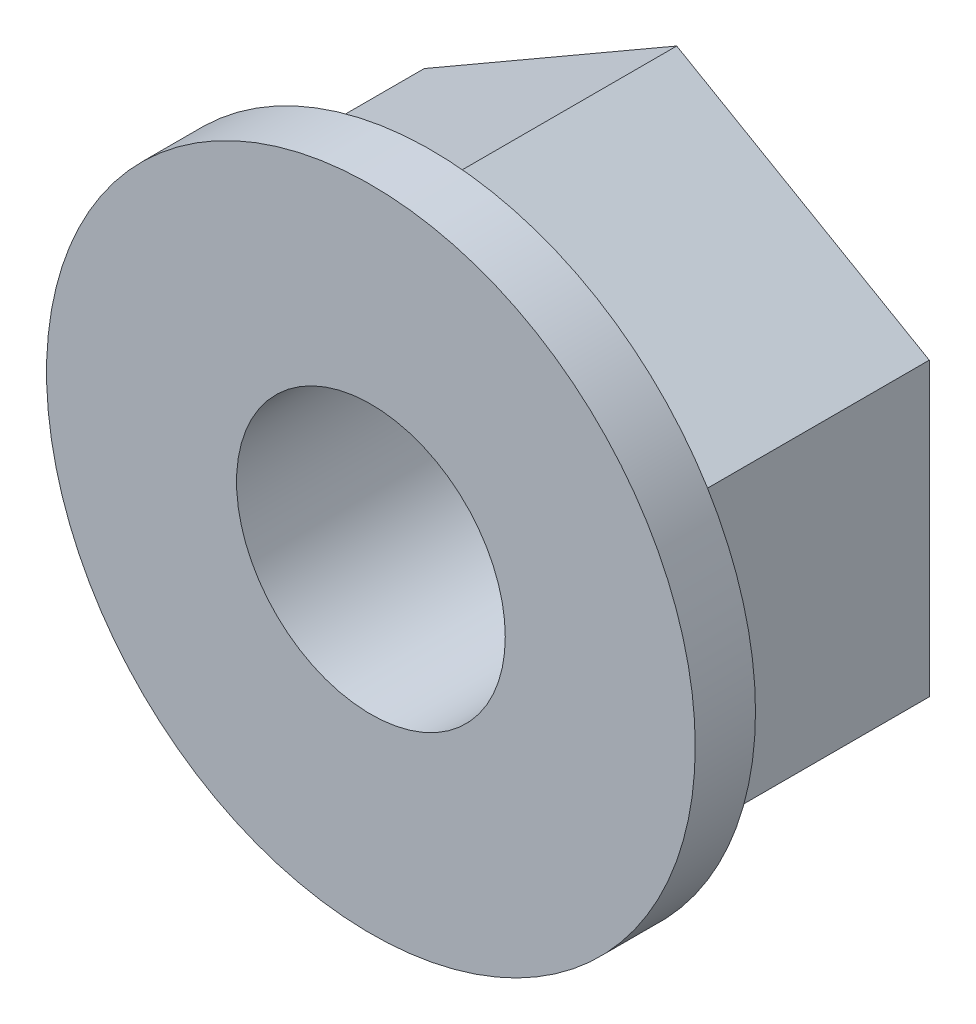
from build123d import *

# Parameters (mm, degrees)
ESQUISSE1_R      = 1.45
EXTRUSION1_DEPTH = 2.65
ESQUISSE2_R      = 3.5
ESQUISSE2_R_2    = 1.45
EXTRUSION2_DEPTH = 0.65


with BuildPart() as part:
    # Esquisse1 → Extrusion1 (new body)
    with BuildSketch(Plane.XY):
        Polygon((0, 3.146558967), (-2.725, 1.573279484), (-2.725, -1.573279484), (0, -3.146558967), (2.725, -1.573279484), (2.725, 1.573279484), align=None)
        Circle(ESQUISSE1_R, mode=Mode.SUBTRACT)
    extrude(amount=EXTRUSION1_DEPTH)

    # Esquisse2 → Extrusion2 (add)
    with BuildSketch(Plane.XY.offset(2.65)):
        Circle(ESQUISSE2_R)
        Circle(ESQUISSE2_R_2, mode=Mode.SUBTRACT)
    extrude(amount=EXTRUSION2_DEPTH)


solid = part.part
